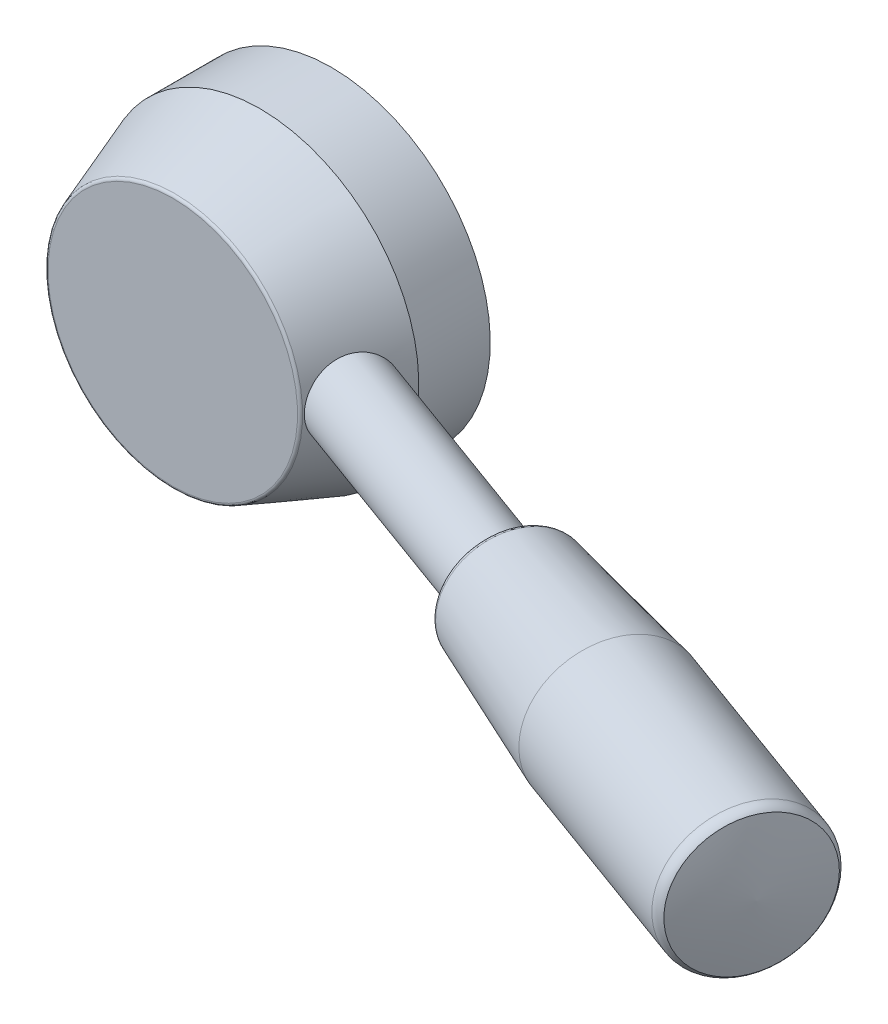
ISO-10303-21;
HEADER;
FILE_DESCRIPTION(('STEP AP214'),'2;1');
FILE_NAME('part.step','',(''),(''),'','','');
FILE_SCHEMA(('AUTOMOTIVE_DESIGN { 1 0 10303 214 1 1 1 1 }'));
ENDSEC;
DATA;
#1=APPLICATION_CONTEXT('core data for automotive mechanical design processes');
#2=APPLICATION_PROTOCOL_DEFINITION('international standard','automotive_design',2000,#1);
#3=PRODUCT_CONTEXT('',#1,'mechanical');
#4=PRODUCT('Part','Part','',(#3));
#5=PRODUCT_RELATED_PRODUCT_CATEGORY('part','',(#4));
#6=PRODUCT_DEFINITION_FORMATION('','',#4);
#7=PRODUCT_DEFINITION_CONTEXT('part definition',#1,'design');
#8=PRODUCT_DEFINITION('design','',#6,#7);
#9=PRODUCT_DEFINITION_SHAPE('','',#8);
#10=(LENGTH_UNIT() NAMED_UNIT(*) SI_UNIT(.MILLI.,.METRE.));
#11=(NAMED_UNIT(*) PLANE_ANGLE_UNIT() SI_UNIT($,.RADIAN.));
#12=(NAMED_UNIT(*) SI_UNIT($,.STERADIAN.) SOLID_ANGLE_UNIT());
#13=UNCERTAINTY_MEASURE_WITH_UNIT(LENGTH_MEASURE(1.E-05),#10,'distance_accuracy_value','');
#14=(GEOMETRIC_REPRESENTATION_CONTEXT(3) GLOBAL_UNCERTAINTY_ASSIGNED_CONTEXT((#13)) GLOBAL_UNIT_ASSIGNED_CONTEXT((#10,
#11,#12)) REPRESENTATION_CONTEXT('',''));
#15=CARTESIAN_POINT('',(0.,0.,0.));
#16=DIRECTION('',(0.,0.,1.));
#17=DIRECTION('',(1.,0.,0.));
#18=AXIS2_PLACEMENT_3D('',#15,#16,#17);
#19=CARTESIAN_POINT('',(0.,0.,24.3420201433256));
#20=DIRECTION('',(0.,0.,-1.));
#21=DIRECTION('',(0.,1.,0.));
#22=AXIS2_PLACEMENT_3D('',#19,#20,#21);
#23=CONICAL_SURFACE('',#22,20.2394850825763,0.349065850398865);
#24=CARTESIAN_POINT('',(0.,0.,24.671010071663));
#25=DIRECTION('',(0.,0.,-1.));
#26=DIRECTION('',(0.,1.,0.));
#27=AXIS2_PLACEMENT_3D('',#24,#25,#26);
#28=CIRCLE('',#27,20.1197425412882);
#29=CARTESIAN_POINT('',(0.,20.1197425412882,24.671010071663));
#30=VERTEX_POINT('',#29);
#31=EDGE_CURVE('E21',#30,#30,#28,.T.);
#32=ORIENTED_EDGE('',*,*,#31,.T.);
#33=EDGE_LOOP('',(#32));
#34=FACE_BOUND('',#33,.T.);
#35=CARTESIAN_POINT('',(23.4822223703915,3.98168131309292,14.511779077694));
#36=CARTESIAN_POINT('',(23.5963370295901,3.73179872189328,14.3174278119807));
#37=CARTESIAN_POINT('',(23.7020867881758,3.46317896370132,14.1420925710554));
#38=CARTESIAN_POINT('',(23.8912576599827,2.89550136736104,13.833470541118));
#39=CARTESIAN_POINT('',(23.9746706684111,2.59643253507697,13.7001990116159));
#40=CARTESIAN_POINT('',(24.1145882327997,1.97574266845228,13.4789130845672));
#41=CARTESIAN_POINT('',(24.1710711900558,1.65410376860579,13.3909350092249));
#42=CARTESIAN_POINT('',(24.253736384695,0.997710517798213,13.2627551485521));
#43=CARTESIAN_POINT('',(24.2799244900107,0.662958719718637,13.2225441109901));
#44=CARTESIAN_POINT('',(24.3002844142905,-0.00415048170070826,13.1912537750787));
#45=CARTESIAN_POINT('',(24.2949859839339,-0.336453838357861,13.1993615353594));
#46=CARTESIAN_POINT('',(24.2539192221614,-0.99462817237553,13.262589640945));
#47=CARTESIAN_POINT('',(24.2181513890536,-1.32049925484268,13.3177092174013));
#48=CARTESIAN_POINT('',(24.1184845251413,-1.95477816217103,13.4730446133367));
#49=CARTESIAN_POINT('',(24.0547460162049,-2.26327446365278,13.5730031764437));
#50=CARTESIAN_POINT('',(23.9026572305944,-2.85655378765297,13.8154779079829));
#51=CARTESIAN_POINT('',(23.8143043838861,-3.14133432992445,13.957998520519));
#52=CARTESIAN_POINT('',(23.6156893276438,-3.68506435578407,14.2854894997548));
#53=CARTESIAN_POINT('',(23.5050385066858,-3.94341186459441,14.471223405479));
#54=CARTESIAN_POINT('',(23.2686388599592,-4.42122721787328,14.8794930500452));
#55=CARTESIAN_POINT('',(23.1428878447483,-4.64068941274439,15.1020341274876));
#56=CARTESIAN_POINT('',(22.8800594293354,-5.03869845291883,15.583745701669));
#57=CARTESIAN_POINT('',(22.7428127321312,-5.21639249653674,15.8435296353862));
#58=CARTESIAN_POINT('',(22.4660074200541,-5.52025299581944,16.3905771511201));
#59=CARTESIAN_POINT('',(22.3264489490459,-5.64642264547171,16.6778390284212));
#60=CARTESIAN_POINT('',(22.0531197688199,-5.84227129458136,17.2699821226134));
#61=CARTESIAN_POINT('',(21.9193062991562,-5.91248201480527,17.5746672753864));
#62=CARTESIAN_POINT('',(21.6620789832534,-5.99594515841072,18.1959726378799));
#63=CARTESIAN_POINT('',(21.5386628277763,-6.00921026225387,18.512590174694));
#64=CARTESIAN_POINT('',(21.3102367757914,-5.97868548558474,19.1395730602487));
#65=CARTESIAN_POINT('',(21.2048071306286,-5.93648829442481,19.4498641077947));
#66=CARTESIAN_POINT('',(21.0109895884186,-5.79917082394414,20.0639645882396));
#67=CARTESIAN_POINT('',(20.9226014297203,-5.70405135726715,20.3677741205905));
#68=CARTESIAN_POINT('',(20.7641216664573,-5.46444929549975,20.9587057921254));
#69=CARTESIAN_POINT('',(20.6939558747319,-5.320172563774,21.2458917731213));
#70=CARTESIAN_POINT('',(20.5706877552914,-4.98639732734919,21.7966823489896));
#71=CARTESIAN_POINT('',(20.517588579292,-4.79689048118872,22.0602825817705));
#72=CARTESIAN_POINT('',(20.4251923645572,-4.37161096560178,22.5634654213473));
#73=CARTESIAN_POINT('',(20.386338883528,-4.13465880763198,22.8021329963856));
#74=CARTESIAN_POINT('',(20.3217549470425,-3.62434496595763,23.2389323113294));
#75=CARTESIAN_POINT('',(20.2960261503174,-3.35097868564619,23.4370589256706));
#76=CARTESIAN_POINT('',(20.25427810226,-2.77006669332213,23.7888512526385));
#77=CARTESIAN_POINT('',(20.2384247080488,-2.46203467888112,23.9417359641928));
#78=CARTESIAN_POINT('',(20.2142180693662,-1.82407354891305,24.1925245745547));
#79=CARTESIAN_POINT('',(20.2058631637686,-1.49414930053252,24.2904406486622));
#80=CARTESIAN_POINT('',(20.1947397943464,-0.830747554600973,24.425275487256));
#81=CARTESIAN_POINT('',(20.1918339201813,-0.497576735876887,24.4636902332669));
#82=CARTESIAN_POINT('',(20.1903806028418,0.170383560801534,24.4825422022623));
#83=CARTESIAN_POINT('',(20.1918324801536,0.505172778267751,24.4629884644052));
#84=CARTESIAN_POINT('',(20.1994123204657,1.15787568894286,24.3680525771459));
#85=CARTESIAN_POINT('',(20.2054198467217,1.47600199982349,24.2941097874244));
#86=CARTESIAN_POINT('',(20.2234062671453,2.09563809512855,24.0950832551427));
#87=CARTESIAN_POINT('',(20.2353858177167,2.39714604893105,23.9699938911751));
#88=CARTESIAN_POINT('',(20.267820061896,2.98072493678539,23.6708215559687));
#89=CARTESIAN_POINT('',(20.2884144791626,3.26238158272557,23.4959467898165));
#90=CARTESIAN_POINT('',(20.3409136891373,3.79358128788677,23.1041327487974));
#91=CARTESIAN_POINT('',(20.3728208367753,4.04311764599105,22.8871847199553));
#92=CARTESIAN_POINT('',(20.4520740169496,4.51126286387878,22.4105018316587));
#93=CARTESIAN_POINT('',(20.4998800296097,4.72863138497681,22.1496229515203));
#94=CARTESIAN_POINT('',(20.6132505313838,5.11653882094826,21.5985253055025));
#95=CARTESIAN_POINT('',(20.6788142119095,5.2870798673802,21.3083078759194));
#96=CARTESIAN_POINT('',(20.8288516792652,5.57549551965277,20.7088983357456));
#97=CARTESIAN_POINT('',(20.913241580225,5.69359701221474,20.3997946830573));
#98=CARTESIAN_POINT('',(21.1007961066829,5.87423456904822,19.7712440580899));
#99=CARTESIAN_POINT('',(21.2039562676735,5.93678382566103,19.4517995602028));
#100=CARTESIAN_POINT('',(21.4232278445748,6.00313189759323,18.8225072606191));
#101=CARTESIAN_POINT('',(21.5388378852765,6.00869399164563,18.5126693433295));
#102=CARTESIAN_POINT('',(21.7815900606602,5.96555132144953,17.9013909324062));
#103=CARTESIAN_POINT('',(21.9087330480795,5.9168425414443,17.5999510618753));
#104=CARTESIAN_POINT('',(22.1686367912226,5.76725921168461,17.0149958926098));
#105=CARTESIAN_POINT('',(22.3013632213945,5.66666990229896,16.7313920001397));
#106=CARTESIAN_POINT('',(22.5672399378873,5.41658375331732,16.1869769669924));
#107=CARTESIAN_POINT('',(22.7003900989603,5.26710023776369,15.9261596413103));
#108=CARTESIAN_POINT('',(22.9464899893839,4.94263032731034,15.4604109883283));
#109=CARTESIAN_POINT('',(23.0600353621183,4.77235426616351,15.2524912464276));
#110=CARTESIAN_POINT('',(23.2785478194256,4.39995350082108,14.8622304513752));
#111=CARTESIAN_POINT('',(23.3835144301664,4.19782703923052,14.679890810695));
#112=CARTESIAN_POINT('',(23.4822223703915,3.98168131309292,14.511779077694));
#113=B_SPLINE_CURVE_WITH_KNOTS('',3,(#35,#36,#37,#38,#39,#40,#41,#42,#43,#44,#45,#46,#47,#48,
#49,#50,#51,#52,#53,#54,#55,#56,#57,#58,#59,#60,#61,#62,#63,#64,#65,#66,#67,#68,#69,#70,#71,#72,
#73,#74,#75,#76,#77,#78,#79,#80,#81,#82,#83,#84,#85,#86,#87,#88,#89,#90,#91,#92,#93,#94,#95,#96,
#97,#98,#99,#100,#101,#102,#103,#104,#105,#106,#107,#108,#109,#110,#111,#112),.UNSPECIFIED.,.T.,
.F.,(4,2,2,2,2,2,2,2,2,2,2,2,2,2,2,2,2,2,2,2,2,2,2,2,2,2,2,2,2,2,2,2,2,2,2,2,2,2,4),(0.,
1.00850426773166,2.01737397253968,3.02705146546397,4.03653335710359,5.02907967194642,
6.02160975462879,7.00851678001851,7.99552688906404,9.00151542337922,10.0076499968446,
11.0328231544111,12.0579327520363,13.073181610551,14.0882043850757,15.0747064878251,
16.0611934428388,17.0435989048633,18.0261856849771,19.0371882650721,20.0483185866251,
21.0760027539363,22.1034592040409,23.1046380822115,24.1056608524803,25.0811043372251,
26.0566550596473,27.0486823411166,28.0409162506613,29.0647986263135,30.0886343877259,
31.1079961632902,32.12711579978,33.1146032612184,34.1021637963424,35.0843516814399,
36.0662721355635,36.938569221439,37.8109144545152),.UNSPECIFIED.);
#114=CARTESIAN_POINT('',(23.4822223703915,3.98168131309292,14.511779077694));
#115=VERTEX_POINT('',#114);
#116=EDGE_CURVE('E51',#115,#115,#113,.T.);
#117=ORIENTED_EDGE('',*,*,#116,.T.);
#118=EDGE_LOOP('',(#117));
#119=FACE_BOUND('',#118,.T.);
#120=CARTESIAN_POINT('',(0.,0.,11.262612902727));
#121=DIRECTION('',(0.,0.,-1.));
#122=DIRECTION('',(0.,1.,0.));
#123=AXIS2_PLACEMENT_3D('',#120,#121,#122);
#124=CIRCLE('',#123,25.);
#125=CARTESIAN_POINT('',(0.,25.,11.262612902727));
#126=VERTEX_POINT('',#125);
#127=EDGE_CURVE('E61',#126,#126,#124,.T.);
#128=ORIENTED_EDGE('',*,*,#127,.F.);
#129=EDGE_LOOP('',(#128));
#130=FACE_BOUND('',#129,.T.);
#131=ADVANCED_FACE('F14',(#34,#119,#130),#23,.T.);
#132=CARTESIAN_POINT('',(0.,0.,-5.));
#133=DIRECTION('',(0.,0.,-1.));
#134=DIRECTION('',(0.,1.,0.));
#135=AXIS2_PLACEMENT_3D('',#132,#133,#134);
#136=CYLINDRICAL_SURFACE('',#135,25.);
#137=ORIENTED_EDGE('',*,*,#127,.T.);
#138=EDGE_LOOP('',(#137));
#139=FACE_BOUND('',#138,.T.);
#140=CARTESIAN_POINT('',(0.,0.,0.));
#141=DIRECTION('',(0.,0.,-1.));
#142=DIRECTION('',(0.,1.,0.));
#143=AXIS2_PLACEMENT_3D('',#140,#141,#142);
#144=CIRCLE('',#143,25.);
#145=CARTESIAN_POINT('',(0.,25.,0.));
#146=VERTEX_POINT('',#145);
#147=EDGE_CURVE('E58',#146,#146,#144,.T.);
#148=ORIENTED_EDGE('',*,*,#147,.F.);
#149=EDGE_LOOP('',(#148));
#150=FACE_BOUND('',#149,.T.);
#151=ADVANCED_FACE('F91',(#139,#150),#136,.T.);
#152=CARTESIAN_POINT('',(-25.,0.,0.));
#153=DIRECTION('',(0.,0.,1.));
#154=DIRECTION('',(0.,-1.,0.));
#155=AXIS2_PLACEMENT_3D('',#152,#153,#154);
#156=PLANE('',#155);
#157=CARTESIAN_POINT('',(0.,0.,0.));
#158=DIRECTION('',(0.,0.,-1.));
#159=DIRECTION('',(0.,1.,0.));
#160=AXIS2_PLACEMENT_3D('',#157,#158,#159);
#161=CIRCLE('',#160,5.);
#162=CARTESIAN_POINT('',(0.,5.,0.));
#163=VERTEX_POINT('',#162);
#164=EDGE_CURVE('E55',#163,#163,#161,.T.);
#165=ORIENTED_EDGE('',*,*,#164,.F.);
#166=EDGE_LOOP('',(#165));
#167=FACE_BOUND('',#166,.T.);
#168=ORIENTED_EDGE('',*,*,#147,.T.);
#169=EDGE_LOOP('',(#168));
#170=FACE_BOUND('',#169,.T.);
#171=ADVANCED_FACE('F88',(#167,#170),#156,.F.);
#172=CARTESIAN_POINT('',(0.,0.,-5.));
#173=DIRECTION('',(0.,0.,-1.));
#174=DIRECTION('',(0.,1.,0.));
#175=AXIS2_PLACEMENT_3D('',#172,#173,#174);
#176=CYLINDRICAL_SURFACE('',#175,5.);
#177=CARTESIAN_POINT('',(0.,0.,16.));
#178=DIRECTION('',(0.,0.,-1.));
#179=DIRECTION('',(0.,1.,0.));
#180=AXIS2_PLACEMENT_3D('',#177,#178,#179);
#181=CIRCLE('',#180,5.00000000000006);
#182=CARTESIAN_POINT('',(0.,5.00000000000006,16.));
#183=VERTEX_POINT('',#182);
#184=EDGE_CURVE('E52',#183,#183,#181,.T.);
#185=ORIENTED_EDGE('',*,*,#184,.F.);
#186=EDGE_LOOP('',(#185));
#187=FACE_BOUND('',#186,.T.);
#188=ORIENTED_EDGE('',*,*,#164,.T.);
#189=EDGE_LOOP('',(#188));
#190=FACE_BOUND('',#189,.T.);
#191=ADVANCED_FACE('F84',(#187,#190),#176,.F.);
#192=CARTESIAN_POINT('',(-5.,0.,16.));
#193=DIRECTION('',(0.,0.,1.));
#194=DIRECTION('',(0.,-1.,0.));
#195=AXIS2_PLACEMENT_3D('',#192,#193,#194);
#196=PLANE('',#195);
#197=ORIENTED_EDGE('',*,*,#184,.T.);
#198=EDGE_LOOP('',(#197));
#199=FACE_BOUND('',#198,.T.);
#200=ADVANCED_FACE('F80',(#199),#196,.F.);
#201=CARTESIAN_POINT('',(-19.2997924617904,0.,25.));
#202=DIRECTION('',(0.,0.,1.));
#203=DIRECTION('',(0.,-1.,0.));
#204=AXIS2_PLACEMENT_3D('',#201,#202,#203);
#205=PLANE('',#204);
#206=CARTESIAN_POINT('',(0.,0.,25.));
#207=DIRECTION('',(0.,0.,1.));
#208=DIRECTION('',(0.,-1.,0.));
#209=AXIS2_PLACEMENT_3D('',#206,#207,#208);
#210=CIRCLE('',#209,19.6498962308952);
#211=CARTESIAN_POINT('',(0.,-19.6498962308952,25.));
#212=VERTEX_POINT('',#211);
#213=EDGE_CURVE('E9',#212,#212,#210,.T.);
#214=ORIENTED_EDGE('',*,*,#213,.T.);
#215=EDGE_LOOP('',(#214));
#216=FACE_BOUND('',#215,.T.);
#217=ADVANCED_FACE('F75',(#216),#205,.T.);
#218=CARTESIAN_POINT('',(-0.304741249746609,0.,10.6305446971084));
#219=DIRECTION('',(-0.939692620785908,0.,-0.342020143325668));
#220=DIRECTION('',(0.342020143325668,0.,-0.939692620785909));
#221=AXIS2_PLACEMENT_3D('',#218,#219,#220);
#222=CYLINDRICAL_SURFACE('',#221,6.);
#223=CARTESIAN_POINT('',(61.0751890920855,0.,32.9710123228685));
#224=DIRECTION('',(-0.939692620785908,0.,-0.342020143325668));
#225=DIRECTION('',(0.342020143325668,0.,-0.939692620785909));
#226=AXIS2_PLACEMENT_3D('',#223,#224,#225);
#227=CIRCLE('',#226,6.);
#228=CARTESIAN_POINT('',(63.1273099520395,0.,27.332856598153));
#229=VERTEX_POINT('',#228);
#230=EDGE_CURVE('E48',#229,#229,#227,.T.);
#231=ORIENTED_EDGE('',*,*,#230,.T.);
#232=EDGE_LOOP('',(#231));
#233=FACE_BOUND('',#232,.T.);
#234=ORIENTED_EDGE('',*,*,#116,.F.);
#235=EDGE_LOOP('',(#234));
#236=FACE_BOUND('',#235,.T.);
#237=ADVANCED_FACE('F69',(#233,#236),#222,.T.);
#238=CARTESIAN_POINT('',(58.1436200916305,0.,41.025431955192));
#239=DIRECTION('',(0.939692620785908,0.,0.342020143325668));
#240=DIRECTION('',(-0.342020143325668,0.,0.939692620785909));
#241=AXIS2_PLACEMENT_3D('',#238,#239,#240);
#242=PLANE('',#241);
#243=ORIENTED_EDGE('',*,*,#230,.F.);
#244=EDGE_LOOP('',(#243));
#245=FACE_BOUND('',#244,.T.);
#246=CARTESIAN_POINT('',(61.0751890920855,0.,32.9710123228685));
#247=DIRECTION('',(-0.939692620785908,0.,-0.342020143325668));
#248=DIRECTION('',(0.342020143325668,0.,-0.939692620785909));
#249=AXIS2_PLACEMENT_3D('',#246,#247,#248);
#250=CIRCLE('',#249,8.57133434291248);
#251=CARTESIAN_POINT('',(64.0067580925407,0.,24.9165926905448));
#252=VERTEX_POINT('',#251);
#253=EDGE_CURVE('E45',#252,#252,#250,.T.);
#254=ORIENTED_EDGE('',*,*,#253,.T.);
#255=EDGE_LOOP('',(#254));
#256=FACE_BOUND('',#255,.T.);
#257=ADVANCED_FACE('F74',(#245,#256),#242,.F.);
#258=CARTESIAN_POINT('',(62.0148817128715,0.,33.313032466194));
#259=DIRECTION('',(-0.939692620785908,0.,-0.342020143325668));
#260=DIRECTION('',(0.342020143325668,0.,-0.939692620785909));
#261=AXIS2_PLACEMENT_3D('',#258,#259,#260);
#262=TOROIDAL_SURFACE('',#261,8.57133434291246,1.00000000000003);
#263=ORIENTED_EDGE('',*,*,#253,.F.);
#264=EDGE_LOOP('',(#263));
#265=FACE_BOUND('',#264,.T.);
#266=CARTESIAN_POINT('',(61.945465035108,0.,33.2877668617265));
#267=DIRECTION('',(-0.939692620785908,0.,-0.342020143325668));
#268=DIRECTION('',(0.342020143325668,0.,-0.939692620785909));
#269=AXIS2_PLACEMENT_3D('',#266,#267,#268);
#270=CIRCLE('',#269,9.56860209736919);
#271=CARTESIAN_POINT('',(58.6728103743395,0.,42.279311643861));
#272=VERTEX_POINT('',#271);
#273=EDGE_CURVE('E42',#272,#272,#270,.T.);
#274=ORIENTED_EDGE('',*,*,#273,.T.);
#275=EDGE_LOOP('',(#274));
#276=FACE_BOUND('',#275,.T.);
#277=ADVANCED_FACE('F129',(#265,#276),#262,.T.);
#278=CARTESIAN_POINT('',(86.446889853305,0.,42.2055561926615));
#279=DIRECTION('',(0.939692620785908,0.,0.342020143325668));
#280=DIRECTION('',(-0.342020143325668,0.,0.939692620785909));
#281=AXIS2_PLACEMENT_3D('',#278,#279,#280);
#282=CONICAL_SURFACE('',#281,11.5,0.0739390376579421);
#283=CARTESIAN_POINT('',(86.446889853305,0.,42.2055561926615));
#284=DIRECTION('',(-0.939692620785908,0.,-0.342020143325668));
#285=DIRECTION('',(0.342020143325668,0.,-0.939692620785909));
#286=AXIS2_PLACEMENT_3D('',#283,#284,#285);
#287=CIRCLE('',#286,11.5);
#288=CARTESIAN_POINT('',(82.5136582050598,0.,53.0120213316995));
#289=VERTEX_POINT('',#288);
#290=EDGE_CURVE('E37',#289,#289,#287,.T.);
#291=CARTESIAN_POINT('',(58.6728103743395,0.,42.279311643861));
#292=CARTESIAN_POINT('',(58.9211525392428,0.,42.3911107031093));
#293=CARTESIAN_POINT('',(59.1694947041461,0.,42.5029097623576));
#294=CARTESIAN_POINT('',(59.6661790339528,0.,42.7265078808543));
#295=CARTESIAN_POINT('',(59.9145211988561,0.,42.8383069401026));
#296=CARTESIAN_POINT('',(60.4112055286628,0.,43.0619050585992));
#297=CARTESIAN_POINT('',(60.6595476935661,0.,43.1737041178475));
#298=CARTESIAN_POINT('',(61.1562320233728,0.,43.3973022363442));
#299=CARTESIAN_POINT('',(61.4045741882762,0.,43.5091012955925));
#300=CARTESIAN_POINT('',(61.9012585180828,0.,43.7326994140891));
#301=CARTESIAN_POINT('',(62.1496006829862,0.,43.8444984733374));
#302=CARTESIAN_POINT('',(62.6462850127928,0.,44.0680965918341));
#303=CARTESIAN_POINT('',(62.8946271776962,0.,44.1798956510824));
#304=CARTESIAN_POINT('',(63.3913115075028,0.,44.403493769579));
#305=CARTESIAN_POINT('',(63.6396536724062,0.,44.5152928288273));
#306=CARTESIAN_POINT('',(64.1363380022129,0.,44.738890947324));
#307=CARTESIAN_POINT('',(64.3846801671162,0.,44.8506900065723));
#308=CARTESIAN_POINT('',(64.8813644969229,0.,45.0742881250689));
#309=CARTESIAN_POINT('',(65.1297066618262,0.,45.1860871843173));
#310=CARTESIAN_POINT('',(65.6263909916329,0.,45.4096853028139));
#311=CARTESIAN_POINT('',(65.8747331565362,0.,45.5214843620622));
#312=CARTESIAN_POINT('',(66.3714174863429,0.,45.7450824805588));
#313=CARTESIAN_POINT('',(66.6197596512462,0.,45.8568815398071));
#314=CARTESIAN_POINT('',(67.1164439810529,0.,46.0804796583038));
#315=CARTESIAN_POINT('',(67.3647861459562,0.,46.1922787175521));
#316=CARTESIAN_POINT('',(67.8614704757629,0.,46.4158768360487));
#317=CARTESIAN_POINT('',(68.1098126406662,0.,46.5276758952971));
#318=CARTESIAN_POINT('',(68.6064969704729,0.,46.7512740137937));
#319=CARTESIAN_POINT('',(68.8548391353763,0.,46.863073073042));
#320=CARTESIAN_POINT('',(69.3515234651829,0.,47.0866711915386));
#321=CARTESIAN_POINT('',(69.5998656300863,0.,47.198470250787));
#322=CARTESIAN_POINT('',(70.096549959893,0.,47.4220683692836));
#323=CARTESIAN_POINT('',(70.3448921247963,0.,47.5338674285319));
#324=CARTESIAN_POINT('',(70.841576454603,0.,47.7574655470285));
#325=CARTESIAN_POINT('',(71.0899186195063,0.,47.8692646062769));
#326=CARTESIAN_POINT('',(71.586602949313,0.,48.0928627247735));
#327=CARTESIAN_POINT('',(71.8349451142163,0.,48.2046617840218));
#328=CARTESIAN_POINT('',(72.331629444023,0.,48.4282599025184));
#329=CARTESIAN_POINT('',(72.5799716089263,0.,48.5400589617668));
#330=CARTESIAN_POINT('',(73.076655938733,0.,48.7636570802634));
#331=CARTESIAN_POINT('',(73.3249981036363,0.,48.8754561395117));
#332=CARTESIAN_POINT('',(73.821682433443,0.,49.0990542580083));
#333=CARTESIAN_POINT('',(74.0700245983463,0.,49.2108533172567));
#334=CARTESIAN_POINT('',(74.566708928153,0.,49.4344514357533));
#335=CARTESIAN_POINT('',(74.8150510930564,0.,49.5462504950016));
#336=CARTESIAN_POINT('',(75.311735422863,0.,49.7698486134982));
#337=CARTESIAN_POINT('',(75.5600775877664,0.,49.8816476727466));
#338=CARTESIAN_POINT('',(76.056761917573,0.,50.1052457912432));
#339=CARTESIAN_POINT('',(76.3051040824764,0.,50.2170448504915));
#340=CARTESIAN_POINT('',(76.801788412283,0.,50.4406429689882));
#341=CARTESIAN_POINT('',(77.0501305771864,0.,50.5524420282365));
#342=CARTESIAN_POINT('',(77.546814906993,0.,50.7760401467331));
#343=CARTESIAN_POINT('',(77.7951570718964,0.,50.8878392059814));
#344=CARTESIAN_POINT('',(78.2918414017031,0.,51.1114373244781));
#345=CARTESIAN_POINT('',(78.5401835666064,0.,51.2232363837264));
#346=CARTESIAN_POINT('',(79.0368678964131,0.,51.446834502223));
#347=CARTESIAN_POINT('',(79.2852100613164,0.,51.5586335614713));
#348=CARTESIAN_POINT('',(79.7818943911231,0.,51.782231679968));
#349=CARTESIAN_POINT('',(80.0302365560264,0.,51.8940307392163));
#350=CARTESIAN_POINT('',(80.5269208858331,0.,52.1176288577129));
#351=CARTESIAN_POINT('',(80.7752630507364,0.,52.2294279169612));
#352=CARTESIAN_POINT('',(81.2719473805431,0.,52.4530260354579));
#353=CARTESIAN_POINT('',(81.5202895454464,0.,52.5648250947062));
#354=CARTESIAN_POINT('',(82.0169738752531,0.,52.7884232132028));
#355=CARTESIAN_POINT('',(82.2653160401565,0.,52.9002222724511));
#356=CARTESIAN_POINT('',(82.5136582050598,0.,53.0120213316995));
#357=B_SPLINE_CURVE_WITH_KNOTS('',3,(#291,#292,#293,#294,#295,#296,#297,#298,#299,#300,#301,
#302,#303,#304,#305,#306,#307,#308,#309,#310,#311,#312,#313,#314,#315,#316,#317,#318,#319,#320,
#321,#322,#323,#324,#325,#326,#327,#328,#329,#330,#331,#332,#333,#334,#335,#336,#337,#338,#339,
#340,#341,#342,#343,#344,#345,#346,#347,#348,#349,#350,#351,#352,#353,#354,#355,#356),
.UNSPECIFIED.,.F.,.F.,(4,2,2,2,2,2,2,2,2,2,2,2,2,2,2,2,2,2,2,2,2,2,2,2,2,2,2,2,2,2,2,2,4),(0.,
0.817040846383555,1.63408169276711,2.45112253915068,3.26816338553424,4.0852042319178,
4.90224507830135,5.71928592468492,6.53632677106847,7.35336761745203,8.1704084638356,
8.98744931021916,9.80449015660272,10.6215310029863,11.4385718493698,12.2556126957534,
13.072653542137,13.8896943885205,14.7067352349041,15.5237760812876,16.3408169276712,
17.1578577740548,17.9748986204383,18.7919394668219,19.6089803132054,20.426021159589,
21.2430620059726,22.0601028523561,22.8771436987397,23.6941845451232,24.5112253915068,
25.3282662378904,26.1453070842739),.UNSPECIFIED.);
#358=EDGE_CURVE('BSEAM126',#272,#289,#357,.T.);
#359=ORIENTED_EDGE('',*,*,#273,.F.);
#360=ORIENTED_EDGE('',*,*,#290,.T.);
#361=ORIENTED_EDGE('',*,*,#358,.T.);
#362=ORIENTED_EDGE('',*,*,#358,.F.);
#363=EDGE_LOOP('',(#359,#361,#360,#362));
#364=FACE_BOUND('',#363,.T.);
#365=ADVANCED_FACE('F126',(#364),#282,.T.);
#366=CARTESIAN_POINT('',(-0.304741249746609,0.,10.6305446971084));
#367=DIRECTION('',(-0.939692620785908,0.,-0.342020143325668));
#368=DIRECTION('',(0.342020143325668,0.,-0.939692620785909));
#369=AXIS2_PLACEMENT_3D('',#366,#367,#368);
#370=CYLINDRICAL_SURFACE('',#369,11.5);
#371=CARTESIAN_POINT('',(119.383590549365,0.,54.193534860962));
#372=DIRECTION('',(-0.939692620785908,0.,-0.342020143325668));
#373=DIRECTION('',(0.342020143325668,0.,-0.939692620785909));
#374=AXIS2_PLACEMENT_3D('',#371,#372,#373);
#375=CIRCLE('',#374,11.5);
#376=CARTESIAN_POINT('',(123.31682219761,0.,43.387069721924));
#377=VERTEX_POINT('',#376);
#378=EDGE_CURVE('E34',#377,#377,#375,.T.);
#379=ORIENTED_EDGE('',*,*,#378,.T.);
#380=EDGE_LOOP('',(#379));
#381=FACE_BOUND('',#380,.T.);
#382=ORIENTED_EDGE('',*,*,#290,.F.);
#383=EDGE_LOOP('',(#382));
#384=FACE_BOUND('',#383,.T.);
#385=ADVANCED_FACE('F122',(#381,#384),#370,.T.);
#386=CARTESIAN_POINT('',(119.48027342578,0.,54.2287245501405));
#387=DIRECTION('',(-0.939692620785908,0.,-0.342020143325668));
#388=DIRECTION('',(0.342020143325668,0.,-0.939692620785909));
#389=AXIS2_PLACEMENT_3D('',#386,#387,#388);
#390=TOROIDAL_SURFACE('',#389,9.50264822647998,1.99999999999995);
#391=ORIENTED_EDGE('',*,*,#378,.F.);
#392=EDGE_LOOP('',(#391));
#393=FACE_BOUND('',#392,.T.);
#394=CARTESIAN_POINT('',(120.921058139,0.,54.753127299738));
#395=DIRECTION('',(-0.939692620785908,0.,-0.342020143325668));
#396=DIRECTION('',(0.342020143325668,0.,-0.939692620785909));
#397=AXIS2_PLACEMENT_3D('',#394,#395,#396);
#398=CIRCLE('',#397,10.7868371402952);
#399=CARTESIAN_POINT('',(124.610373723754,0.,44.6168160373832));
#400=VERTEX_POINT('',#399);
#401=EDGE_CURVE('E32',#400,#400,#398,.T.);
#402=ORIENTED_EDGE('',*,*,#401,.T.);
#403=EDGE_LOOP('',(#402));
#404=FACE_BOUND('',#403,.T.);
#405=ADVANCED_FACE('F28',(#393,#404),#390,.T.);
#406=CARTESIAN_POINT('',(41.470526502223,0.,30.9111312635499));
#407=DIRECTION('',(0.,1.,0.));
#408=DIRECTION('',(0.342020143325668,0.,-0.939692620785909));
#409=AXIS2_PLACEMENT_3D('',#406,#407,#408);
#410=CIRCLE('',#409,84.2619723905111);
#411=TRIMMED_CURVE('',#410,(PARAMETER_VALUE(-1.5141624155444)),
(PARAMETER_VALUE(1.5141624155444)),.T.,.PARAMETER.);
#412=CARTESIAN_POINT('',(43.101803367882,0.,26.429234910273));
#413=DIRECTION('',(-0.939692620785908,0.,-0.342020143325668));
#414=AXIS1_PLACEMENT('',#412,#413);
#415=SURFACE_OF_REVOLUTION('',#411,#414);
#416=CARTESIAN_POINT('',(122.155209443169,0.,55.202321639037));
#417=VERTEX_POINT('',#416);
#418=VERTEX_LOOP('',#417);
#419=FACE_BOUND('',#418,.T.);
#420=ORIENTED_EDGE('',*,*,#401,.F.);
#421=EDGE_LOOP('',(#420));
#422=FACE_BOUND('',#421,.T.);
#423=ADVANCED_FACE('F24',(#419,#422),#415,.T.);
#424=CARTESIAN_POINT('',(0.,0.,24.5));
#425=DIRECTION('',(0.,0.,1.));
#426=DIRECTION('',(0.,-1.,0.));
#427=AXIS2_PLACEMENT_3D('',#424,#425,#426);
#428=TOROIDAL_SURFACE('',#427,19.6498962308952,0.5);
#429=ORIENTED_EDGE('',*,*,#213,.F.);
#430=EDGE_LOOP('',(#429));
#431=FACE_BOUND('',#430,.T.);
#432=ORIENTED_EDGE('',*,*,#31,.F.);
#433=EDGE_LOOP('',(#432));
#434=FACE_BOUND('',#433,.T.);
#435=ADVANCED_FACE('F27',(#431,#434),#428,.T.);
#436=CLOSED_SHELL('',(#131,#151,#171,#191,#200,#217,#237,#257,#277,#365,#385,#405,#423,#435));
#437=MANIFOLD_SOLID_BREP('B1',#436);
#438=ADVANCED_BREP_SHAPE_REPRESENTATION('',(#18,#437),#14);
#439=SHAPE_DEFINITION_REPRESENTATION(#9,#438);
ENDSEC;
END-ISO-10303-21;
